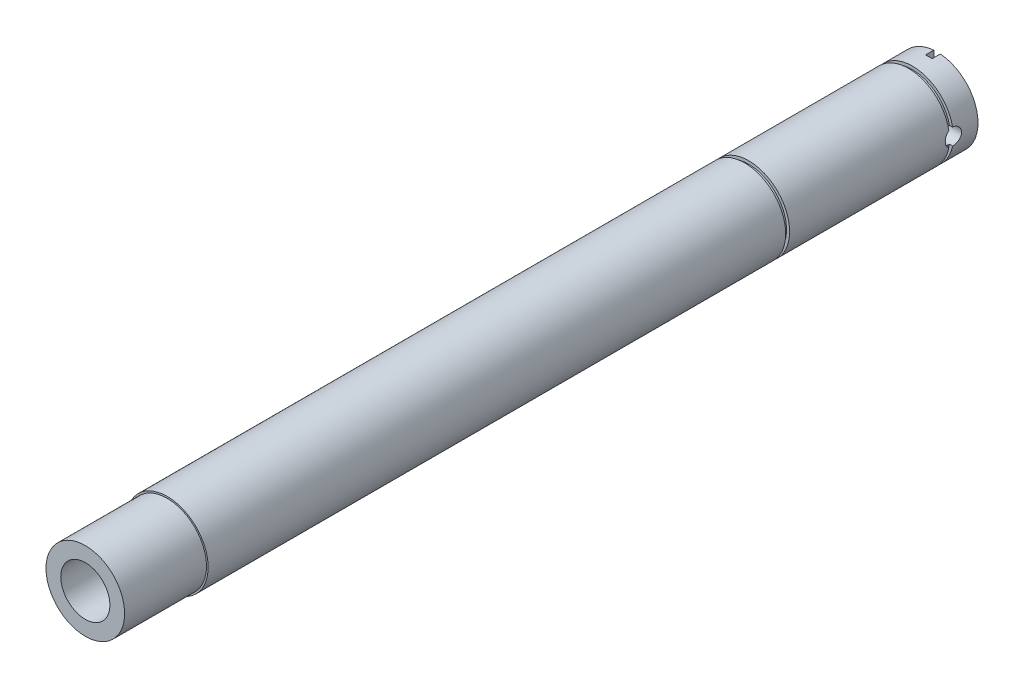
from build123d import *

# Parameters (mm, degrees)
CUT_EXTRUDE1_DEPTH          = 270.804195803
CUT_EXTRUDE1_DEPTH_BACK     = 270.804195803
SKETCH2_W                   = 2.54
SKETCH2_H                   = 6.35
F_1_4_0_25_DIAMETER_HOLE1_D = 6.35


with BuildPart() as part:
    # Sketch1 → Revolve1 (revolve)
    with BuildSketch(Plane(origin=(0, 0, 0), x_dir=(1, 0, 0), z_dir=(0, 1, 0))):
        Polygon((-15.875, 194.319504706), (-15.875, -29.581495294), (-15.24, -29.581495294), (-15.24, -61.331495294), (-9.525, -61.331495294), (-9.525, 268.868504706), (-15.875, 268.868504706), (-15.875, 259.343504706), (-14.6812, 259.343504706), (-14.6812, 257.819504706), (-15.875, 257.819504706), (-15.875, 195.843504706), (-14.6812, 195.843504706), (-14.6812, 194.319504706), align=None)
    revolve(axis=Axis((0, 0, -317.264715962), (0, 0, 1)))

    # Sketch2 → Cut-Extrude1 (cut, two sides: drawn at the far end of the back side and taken through both)
    with BuildSketch(Plane(origin=(0, 0, 0), x_dir=(1, 0, 0), z_dir=(0, 1, 0)).offset(-CUT_EXTRUDE1_DEPTH_BACK)):
        with Locations((0, 268.868504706)):
            Rectangle(SKETCH2_W, SKETCH2_H)
    extrude(amount=CUT_EXTRUDE1_DEPTH + CUT_EXTRUDE1_DEPTH_BACK, mode=Mode.SUBTRACT)

    # 1_4 _0.25_ Diameter Hole1 (through all)
    with Locations(Plane(origin=(-15.875, 0, -259.343504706), x_dir=(0, 0, -1), z_dir=(-1, 0, 0))):
        with Locations((0, 0)):
            Hole(F_1_4_0_25_DIAMETER_HOLE1_D / 2)


solid = part.part
